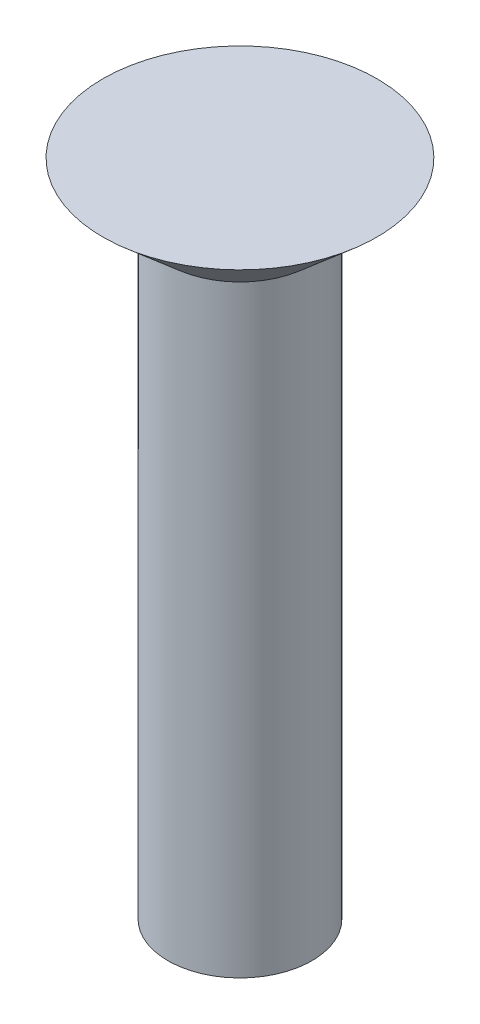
ISO-10303-21;
HEADER;
FILE_DESCRIPTION(('STEP AP214'),'2;1');
FILE_NAME('part.step','',(''),(''),'','','');
FILE_SCHEMA(('AUTOMOTIVE_DESIGN { 1 0 10303 214 1 1 1 1 }'));
ENDSEC;
DATA;
#1=APPLICATION_CONTEXT('core data for automotive mechanical design processes');
#2=APPLICATION_PROTOCOL_DEFINITION('international standard','automotive_design',2000,#1);
#3=PRODUCT_CONTEXT('',#1,'mechanical');
#4=PRODUCT('Part','Part','',(#3));
#5=PRODUCT_RELATED_PRODUCT_CATEGORY('part','',(#4));
#6=PRODUCT_DEFINITION_FORMATION('','',#4);
#7=PRODUCT_DEFINITION_CONTEXT('part definition',#1,'design');
#8=PRODUCT_DEFINITION('design','',#6,#7);
#9=PRODUCT_DEFINITION_SHAPE('','',#8);
#10=(LENGTH_UNIT() NAMED_UNIT(*) SI_UNIT(.MILLI.,.METRE.));
#11=(NAMED_UNIT(*) PLANE_ANGLE_UNIT() SI_UNIT($,.RADIAN.));
#12=(NAMED_UNIT(*) SI_UNIT($,.STERADIAN.) SOLID_ANGLE_UNIT());
#13=UNCERTAINTY_MEASURE_WITH_UNIT(LENGTH_MEASURE(1.E-05),#10,'distance_accuracy_value','');
#14=(GEOMETRIC_REPRESENTATION_CONTEXT(3) GLOBAL_UNCERTAINTY_ASSIGNED_CONTEXT((#13)) GLOBAL_UNIT_ASSIGNED_CONTEXT((#10,
#11,#12)) REPRESENTATION_CONTEXT('',''));
#15=CARTESIAN_POINT('',(0.,0.,0.));
#16=DIRECTION('',(0.,0.,1.));
#17=DIRECTION('',(1.,0.,0.));
#18=AXIS2_PLACEMENT_3D('',#15,#16,#17);
#19=CARTESIAN_POINT('',(0.,0.,0.));
#20=DIRECTION('',(0.,-1.,0.));
#21=DIRECTION('',(1.,0.,0.));
#22=AXIS2_PLACEMENT_3D('',#19,#20,#21);
#23=PLANE('',#22);
#24=CARTESIAN_POINT('',(0.,0.,0.));
#25=DIRECTION('',(0.,1.,0.));
#26=DIRECTION('',(-1.,0.,0.));
#27=AXIS2_PLACEMENT_3D('',#24,#25,#26);
#28=CIRCLE('',#27,3.9624);
#29=CARTESIAN_POINT('',(-3.9624,0.,0.));
#30=VERTEX_POINT('',#29);
#31=EDGE_CURVE('E10',#30,#30,#28,.T.);
#32=ORIENTED_EDGE('',*,*,#31,.T.);
#33=EDGE_LOOP('',(#32));
#34=FACE_BOUND('',#33,.T.);
#35=ADVANCED_FACE('F31',(#34),#23,.F.);
#36=CARTESIAN_POINT('',(0.,-1.63391135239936,0.));
#37=DIRECTION('',(0.,1.,0.));
#38=DIRECTION('',(-1.,0.,0.));
#39=AXIS2_PLACEMENT_3D('',#36,#37,#38);
#40=CONICAL_SURFACE('',#39,2.0828,0.855211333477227);
#41=ORIENTED_EDGE('',*,*,#31,.F.);
#42=EDGE_LOOP('',(#41));
#43=FACE_BOUND('',#42,.T.);
#44=CARTESIAN_POINT('',(0.,-1.63391135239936,0.));
#45=DIRECTION('',(0.,1.,0.));
#46=DIRECTION('',(-1.,0.,0.));
#47=AXIS2_PLACEMENT_3D('',#44,#45,#46);
#48=CIRCLE('',#47,2.0828);
#49=CARTESIAN_POINT('',(-2.0828,-1.63391135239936,0.));
#50=VERTEX_POINT('',#49);
#51=EDGE_CURVE('E37',#50,#50,#48,.T.);
#52=ORIENTED_EDGE('',*,*,#51,.T.);
#53=EDGE_LOOP('',(#52));
#54=FACE_BOUND('',#53,.T.);
#55=ADVANCED_FACE('F56',(#43,#54),#40,.T.);
#56=CARTESIAN_POINT('',(0.,0.,0.));
#57=DIRECTION('',(0.,1.,0.));
#58=DIRECTION('',(-1.,0.,0.));
#59=AXIS2_PLACEMENT_3D('',#56,#57,#58);
#60=CYLINDRICAL_SURFACE('',#59,2.0828);
#61=ORIENTED_EDGE('',*,*,#51,.F.);
#62=EDGE_LOOP('',(#61));
#63=FACE_BOUND('',#62,.T.);
#64=CARTESIAN_POINT('',(0.,-19.05,0.));
#65=DIRECTION('',(0.,1.,0.));
#66=DIRECTION('',(-1.,0.,0.));
#67=AXIS2_PLACEMENT_3D('',#64,#65,#66);
#68=CIRCLE('',#67,2.0828);
#69=CARTESIAN_POINT('',(-2.0828,-19.05,0.));
#70=VERTEX_POINT('',#69);
#71=EDGE_CURVE('E41',#70,#70,#68,.T.);
#72=ORIENTED_EDGE('',*,*,#71,.T.);
#73=EDGE_LOOP('',(#72));
#74=FACE_BOUND('',#73,.T.);
#75=ADVANCED_FACE('F48',(#63,#74),#60,.T.);
#76=CARTESIAN_POINT('',(2.0828,-19.05,0.));
#77=DIRECTION('',(0.,1.,0.));
#78=DIRECTION('',(-1.,0.,0.));
#79=AXIS2_PLACEMENT_3D('',#76,#77,#78);
#80=PLANE('',#79);
#81=ORIENTED_EDGE('',*,*,#71,.F.);
#82=EDGE_LOOP('',(#81));
#83=FACE_BOUND('',#82,.T.);
#84=ADVANCED_FACE('F50',(#83),#80,.F.);
#85=CLOSED_SHELL('',(#35,#55,#75,#84));
#86=MANIFOLD_SOLID_BREP('B2',#85);
#87=ADVANCED_BREP_SHAPE_REPRESENTATION('',(#18,#86),#14);
#88=SHAPE_DEFINITION_REPRESENTATION(#9,#87);
ENDSEC;
END-ISO-10303-21;
